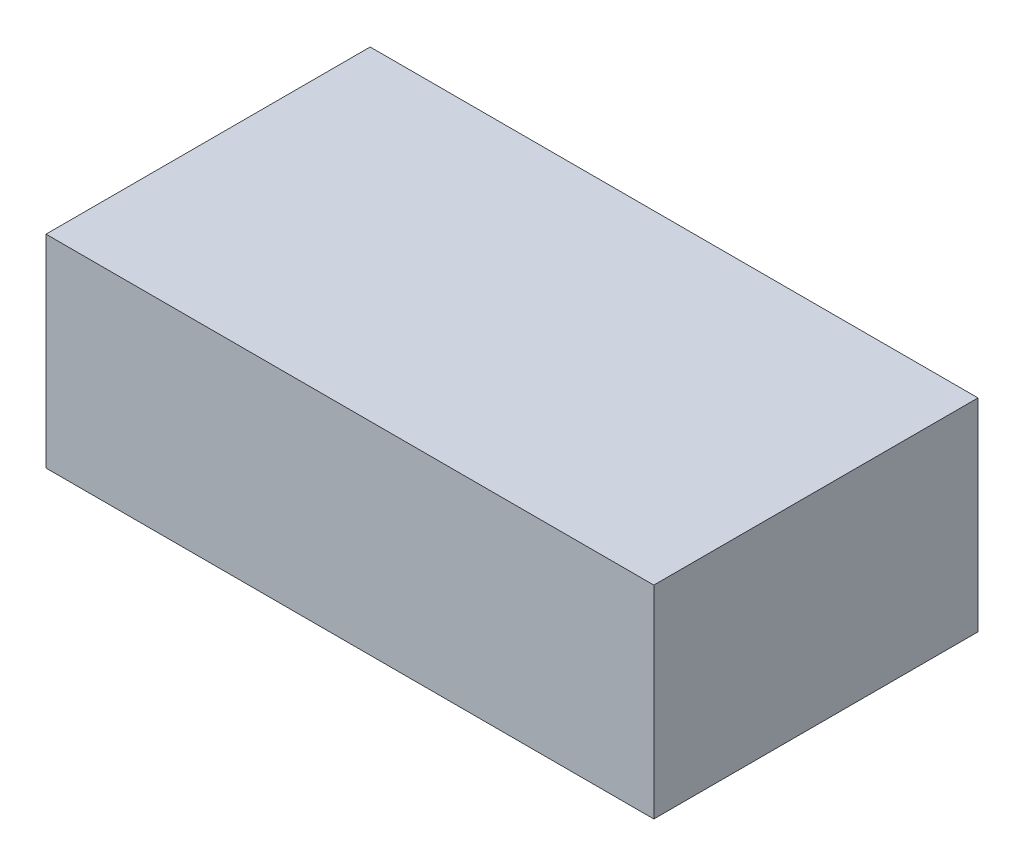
ISO-10303-21;
HEADER;
FILE_DESCRIPTION(('STEP AP214'),'2;1');
FILE_NAME('part.step','',(''),(''),'','','');
FILE_SCHEMA(('AUTOMOTIVE_DESIGN { 1 0 10303 214 1 1 1 1 }'));
ENDSEC;
DATA;
#1=APPLICATION_CONTEXT('core data for automotive mechanical design processes');
#2=APPLICATION_PROTOCOL_DEFINITION('international standard','automotive_design',2000,#1);
#3=PRODUCT_CONTEXT('',#1,'mechanical');
#4=PRODUCT('Part','Part','',(#3));
#5=PRODUCT_RELATED_PRODUCT_CATEGORY('part','',(#4));
#6=PRODUCT_DEFINITION_FORMATION('','',#4);
#7=PRODUCT_DEFINITION_CONTEXT('part definition',#1,'design');
#8=PRODUCT_DEFINITION('design','',#6,#7);
#9=PRODUCT_DEFINITION_SHAPE('','',#8);
#10=(LENGTH_UNIT() NAMED_UNIT(*) SI_UNIT(.MILLI.,.METRE.));
#11=(NAMED_UNIT(*) PLANE_ANGLE_UNIT() SI_UNIT($,.RADIAN.));
#12=(NAMED_UNIT(*) SI_UNIT($,.STERADIAN.) SOLID_ANGLE_UNIT());
#13=UNCERTAINTY_MEASURE_WITH_UNIT(LENGTH_MEASURE(1.E-05),#10,'distance_accuracy_value','');
#14=(GEOMETRIC_REPRESENTATION_CONTEXT(3) GLOBAL_UNCERTAINTY_ASSIGNED_CONTEXT((#13)) GLOBAL_UNIT_ASSIGNED_CONTEXT((#10,
#11,#12)) REPRESENTATION_CONTEXT('',''));
#15=CARTESIAN_POINT('',(0.,0.,0.));
#16=DIRECTION('',(0.,0.,1.));
#17=DIRECTION('',(1.,0.,0.));
#18=AXIS2_PLACEMENT_3D('',#15,#16,#17);
#19=CARTESIAN_POINT('',(0.,7.98492676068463,0.));
#20=DIRECTION('',(0.,1.,0.));
#21=DIRECTION('',(0.,0.,1.));
#22=AXIS2_PLACEMENT_3D('',#19,#20,#21);
#23=PLANE('',#22);
#24=DIRECTION('',(0.,0.,1.));
#25=VECTOR('',#24,1.);
#26=CARTESIAN_POINT('',(-88.3451897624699,7.98492676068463,-40.));
#27=LINE('',#26,#25);
#28=CARTESIAN_POINT('',(-88.3451897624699,7.98492676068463,-40.));
#29=VERTEX_POINT('',#28);
#30=CARTESIAN_POINT('',(-88.3451897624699,7.98492676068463,40.));
#31=VERTEX_POINT('',#30);
#32=EDGE_CURVE('E149',#29,#31,#27,.T.);
#33=ORIENTED_EDGE('',*,*,#32,.F.);
#34=DIRECTION('',(1.,0.,0.));
#35=VECTOR('',#34,1.);
#36=CARTESIAN_POINT('',(-88.3451897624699,7.98492676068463,-40.));
#37=LINE('',#36,#35);
#38=CARTESIAN_POINT('',(61.6548102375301,7.98492676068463,-40.));
#39=VERTEX_POINT('',#38);
#40=EDGE_CURVE('E155',#29,#39,#37,.T.);
#41=ORIENTED_EDGE('',*,*,#40,.T.);
#42=DIRECTION('',(0.,0.,1.));
#43=VECTOR('',#42,1.);
#44=CARTESIAN_POINT('',(61.6548102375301,7.98492676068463,-40.));
#45=LINE('',#44,#43);
#46=CARTESIAN_POINT('',(61.6548102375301,7.98492676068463,40.));
#47=VERTEX_POINT('',#46);
#48=EDGE_CURVE('E166',#39,#47,#45,.T.);
#49=ORIENTED_EDGE('',*,*,#48,.T.);
#50=DIRECTION('',(1.,0.,0.));
#51=VECTOR('',#50,1.);
#52=CARTESIAN_POINT('',(-88.3451897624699,7.98492676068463,40.));
#53=LINE('',#52,#51);
#54=EDGE_CURVE('E163',#31,#47,#53,.T.);
#55=ORIENTED_EDGE('',*,*,#54,.F.);
#56=EDGE_LOOP('',(#33,#41,#49,#55));
#57=FACE_BOUND('',#56,.T.);
#58=DIRECTION('',(0.,0.,-1.));
#59=VECTOR('',#58,1.);
#60=CARTESIAN_POINT('',(-63.1459556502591,7.98492676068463,0.));
#61=LINE('',#60,#59);
#62=CARTESIAN_POINT('',(-63.1459556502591,7.98492676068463,21.5121002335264));
#63=VERTEX_POINT('',#62);
#64=CARTESIAN_POINT('',(-63.1459556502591,7.98492676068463,-18.4878997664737));
#65=VERTEX_POINT('',#64);
#66=EDGE_CURVE('E11',#63,#65,#61,.T.);
#67=ORIENTED_EDGE('',*,*,#66,.F.);
#68=CARTESIAN_POINT('',(-53.1459556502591,7.98492676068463,21.5121002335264));
#69=DIRECTION('',(0.,1.,0.));
#70=DIRECTION('',(0.,0.,1.));
#71=AXIS2_PLACEMENT_3D('',#68,#69,#70);
#72=CIRCLE('',#71,10.);
#73=CARTESIAN_POINT('',(-53.145955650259,7.98492676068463,31.5121002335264));
#74=VERTEX_POINT('',#73);
#75=EDGE_CURVE('E135',#74,#63,#72,.F.);
#76=ORIENTED_EDGE('',*,*,#75,.F.);
#77=DIRECTION('',(-1.,0.,0.));
#78=VECTOR('',#77,1.);
#79=CARTESIAN_POINT('',(-63.1459556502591,7.98492676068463,31.5121002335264));
#80=LINE('',#79,#78);
#81=CARTESIAN_POINT('',(2.71190872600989,7.98492676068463,31.5121002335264));
#82=VERTEX_POINT('',#81);
#83=EDGE_CURVE('E127',#82,#74,#80,.T.);
#84=ORIENTED_EDGE('',*,*,#83,.F.);
#85=CARTESIAN_POINT('',(2.71190872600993,7.98492676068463,21.5121002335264));
#86=DIRECTION('',(0.,1.,0.));
#87=DIRECTION('',(0.,0.,1.));
#88=AXIS2_PLACEMENT_3D('',#85,#86,#87);
#89=CIRCLE('',#88,10.);
#90=CARTESIAN_POINT('',(9.78297653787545,7.98492676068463,28.5831680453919));
#91=VERTEX_POINT('',#90);
#92=EDGE_CURVE('E118',#91,#82,#89,.F.);
#93=ORIENTED_EDGE('',*,*,#92,.F.);
#94=DIRECTION('',(0.707106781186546,0.,-0.707106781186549));
#95=VECTOR('',#94,1.);
#96=CARTESIAN_POINT('',(36.8540443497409,7.98492676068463,1.51210023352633));
#97=LINE('',#96,#95);
#98=CARTESIAN_POINT('',(36.8540443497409,7.98492676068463,1.51210023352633));
#99=VERTEX_POINT('',#98);
#100=EDGE_CURVE('E107',#99,#91,#97,.F.);
#101=ORIENTED_EDGE('',*,*,#100,.F.);
#102=DIRECTION('',(-0.707106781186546,0.,-0.707106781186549));
#103=VECTOR('',#102,1.);
#104=CARTESIAN_POINT('',(36.8540443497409,7.98492676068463,1.51210023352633));
#105=LINE('',#104,#103);
#106=CARTESIAN_POINT('',(9.78297653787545,7.98492676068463,-25.5589675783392));
#107=VERTEX_POINT('',#106);
#108=EDGE_CURVE('E48',#107,#99,#105,.F.);
#109=ORIENTED_EDGE('',*,*,#108,.F.);
#110=CARTESIAN_POINT('',(2.71190872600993,7.98492676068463,-18.4878997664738));
#111=DIRECTION('',(0.,1.,0.));
#112=DIRECTION('',(0.,0.,1.));
#113=AXIS2_PLACEMENT_3D('',#110,#111,#112);
#114=CIRCLE('',#113,10.);
#115=CARTESIAN_POINT('',(2.71190872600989,7.98492676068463,-28.4878997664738));
#116=VERTEX_POINT('',#115);
#117=EDGE_CURVE('E121',#116,#107,#114,.F.);
#118=ORIENTED_EDGE('',*,*,#117,.F.);
#119=DIRECTION('',(-1.,0.,0.));
#120=VECTOR('',#119,1.);
#121=CARTESIAN_POINT('',(-63.1459556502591,7.98492676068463,-28.4878997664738));
#122=LINE('',#121,#120);
#123=CARTESIAN_POINT('',(-53.145955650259,7.98492676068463,-28.4878997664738));
#124=VERTEX_POINT('',#123);
#125=EDGE_CURVE('E133',#124,#116,#122,.F.);
#126=ORIENTED_EDGE('',*,*,#125,.F.);
#127=CARTESIAN_POINT('',(-53.1459556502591,7.98492676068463,-18.4878997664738));
#128=DIRECTION('',(0.,1.,0.));
#129=DIRECTION('',(0.,0.,1.));
#130=AXIS2_PLACEMENT_3D('',#127,#128,#129);
#131=CIRCLE('',#130,10.);
#132=EDGE_CURVE('E41',#65,#124,#131,.F.);
#133=ORIENTED_EDGE('',*,*,#132,.F.);
#134=EDGE_LOOP('',(#67,#76,#84,#93,#101,#109,#118,#126,#133));
#135=FACE_BOUND('',#134,.T.);
#136=ADVANCED_FACE('F33',(#57,#135),#23,.F.);
#137=CARTESIAN_POINT('',(-88.3451897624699,57.9849267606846,-40.));
#138=DIRECTION('',(1.,0.,0.));
#139=DIRECTION('',(0.,0.,-1.));
#140=AXIS2_PLACEMENT_3D('',#137,#138,#139);
#141=PLANE('',#140);
#142=ORIENTED_EDGE('',*,*,#32,.T.);
#143=DIRECTION('',(0.,-1.,0.));
#144=VECTOR('',#143,1.);
#145=CARTESIAN_POINT('',(-88.3451897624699,57.9849267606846,40.));
#146=LINE('',#145,#144);
#147=CARTESIAN_POINT('',(-88.3451897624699,57.9849267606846,40.));
#148=VERTEX_POINT('',#147);
#149=EDGE_CURVE('E113',#148,#31,#146,.T.);
#150=ORIENTED_EDGE('',*,*,#149,.F.);
#151=DIRECTION('',(0.,0.,1.));
#152=VECTOR('',#151,1.);
#153=CARTESIAN_POINT('',(-88.3451897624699,57.9849267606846,-40.));
#154=LINE('',#153,#152);
#155=CARTESIAN_POINT('',(-88.3451897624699,57.9849267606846,-40.));
#156=VERTEX_POINT('',#155);
#157=EDGE_CURVE('E153',#156,#148,#154,.T.);
#158=ORIENTED_EDGE('',*,*,#157,.F.);
#159=DIRECTION('',(0.,-1.,0.));
#160=VECTOR('',#159,1.);
#161=CARTESIAN_POINT('',(-88.3451897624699,57.9849267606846,-40.));
#162=LINE('',#161,#160);
#163=EDGE_CURVE('E57',#156,#29,#162,.T.);
#164=ORIENTED_EDGE('',*,*,#163,.T.);
#165=EDGE_LOOP('',(#142,#150,#158,#164));
#166=FACE_BOUND('',#165,.T.);
#167=ADVANCED_FACE('F35',(#166),#141,.F.);
#168=CARTESIAN_POINT('',(-88.3451897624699,57.9849267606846,40.));
#169=DIRECTION('',(0.,0.,-1.));
#170=DIRECTION('',(-1.,0.,0.));
#171=AXIS2_PLACEMENT_3D('',#168,#169,#170);
#172=PLANE('',#171);
#173=ORIENTED_EDGE('',*,*,#54,.T.);
#174=DIRECTION('',(0.,-1.,0.));
#175=VECTOR('',#174,1.);
#176=CARTESIAN_POINT('',(61.6548102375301,57.9849267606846,40.));
#177=LINE('',#176,#175);
#178=CARTESIAN_POINT('',(61.6548102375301,57.9849267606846,40.));
#179=VERTEX_POINT('',#178);
#180=EDGE_CURVE('E174',#179,#47,#177,.T.);
#181=ORIENTED_EDGE('',*,*,#180,.F.);
#182=DIRECTION('',(1.,0.,0.));
#183=VECTOR('',#182,1.);
#184=CARTESIAN_POINT('',(-88.3451897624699,57.9849267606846,40.));
#185=LINE('',#184,#183);
#186=EDGE_CURVE('E84',#148,#179,#185,.T.);
#187=ORIENTED_EDGE('',*,*,#186,.F.);
#188=ORIENTED_EDGE('',*,*,#149,.T.);
#189=EDGE_LOOP('',(#173,#181,#187,#188));
#190=FACE_BOUND('',#189,.T.);
#191=ADVANCED_FACE('F177',(#190),#172,.F.);
#192=CARTESIAN_POINT('',(61.6548102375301,57.9849267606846,-40.));
#193=DIRECTION('',(1.,0.,0.));
#194=DIRECTION('',(0.,0.,-1.));
#195=AXIS2_PLACEMENT_3D('',#192,#193,#194);
#196=PLANE('',#195);
#197=ORIENTED_EDGE('',*,*,#48,.F.);
#198=DIRECTION('',(0.,-1.,0.));
#199=VECTOR('',#198,1.);
#200=CARTESIAN_POINT('',(61.6548102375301,57.9849267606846,-40.));
#201=LINE('',#200,#199);
#202=CARTESIAN_POINT('',(61.6548102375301,57.9849267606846,-40.));
#203=VERTEX_POINT('',#202);
#204=EDGE_CURVE('E172',#203,#39,#201,.T.);
#205=ORIENTED_EDGE('',*,*,#204,.F.);
#206=DIRECTION('',(0.,0.,1.));
#207=VECTOR('',#206,1.);
#208=CARTESIAN_POINT('',(61.6548102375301,57.9849267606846,-40.));
#209=LINE('',#208,#207);
#210=EDGE_CURVE('E157',#203,#179,#209,.T.);
#211=ORIENTED_EDGE('',*,*,#210,.T.);
#212=ORIENTED_EDGE('',*,*,#180,.T.);
#213=EDGE_LOOP('',(#197,#205,#211,#212));
#214=FACE_BOUND('',#213,.T.);
#215=ADVANCED_FACE('F184',(#214),#196,.T.);
#216=CARTESIAN_POINT('',(-88.3451897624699,57.9849267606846,-40.));
#217=DIRECTION('',(0.,0.,-1.));
#218=DIRECTION('',(-1.,0.,0.));
#219=AXIS2_PLACEMENT_3D('',#216,#217,#218);
#220=PLANE('',#219);
#221=ORIENTED_EDGE('',*,*,#40,.F.);
#222=ORIENTED_EDGE('',*,*,#163,.F.);
#223=DIRECTION('',(1.,0.,0.));
#224=VECTOR('',#223,1.);
#225=CARTESIAN_POINT('',(-88.3451897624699,57.9849267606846,-40.));
#226=LINE('',#225,#224);
#227=EDGE_CURVE('E160',#156,#203,#226,.T.);
#228=ORIENTED_EDGE('',*,*,#227,.T.);
#229=ORIENTED_EDGE('',*,*,#204,.T.);
#230=EDGE_LOOP('',(#221,#222,#228,#229));
#231=FACE_BOUND('',#230,.T.);
#232=ADVANCED_FACE('F179',(#231),#220,.T.);
#233=CARTESIAN_POINT('',(0.,57.9849267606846,0.));
#234=DIRECTION('',(0.,1.,0.));
#235=DIRECTION('',(0.,0.,1.));
#236=AXIS2_PLACEMENT_3D('',#233,#234,#235);
#237=PLANE('',#236);
#238=ORIENTED_EDGE('',*,*,#157,.T.);
#239=ORIENTED_EDGE('',*,*,#186,.T.);
#240=ORIENTED_EDGE('',*,*,#210,.F.);
#241=ORIENTED_EDGE('',*,*,#227,.F.);
#242=EDGE_LOOP('',(#238,#239,#240,#241));
#243=FACE_BOUND('',#242,.T.);
#244=ADVANCED_FACE('F186',(#243),#237,.T.);
#245=CARTESIAN_POINT('',(-63.1459556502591,7.98492676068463,1.51210023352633));
#246=DIRECTION('',(1.,0.,0.));
#247=DIRECTION('',(0.,0.,-1.));
#248=AXIS2_PLACEMENT_3D('',#245,#246,#247);
#249=PLANE('',#248);
#250=ORIENTED_EDGE('',*,*,#66,.T.);
#251=CARTESIAN_POINT('',(-63.1459556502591,7.98492676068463,1.51210023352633));
#252=DIRECTION('',(-1.,0.,0.));
#253=DIRECTION('',(0.,0.,1.));
#254=AXIS2_PLACEMENT_3D('',#251,#252,#253);
#255=CIRCLE('',#254,20.);
#256=EDGE_CURVE('E144',#63,#65,#255,.T.);
#257=ORIENTED_EDGE('',*,*,#256,.F.);
#258=EDGE_LOOP('',(#250,#257));
#259=FACE_BOUND('',#258,.T.);
#260=ADVANCED_FACE('F188',(#259),#249,.T.);
#261=CARTESIAN_POINT('',(-53.1459556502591,7.98492676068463,1.51210023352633));
#262=DIRECTION('',(-1.,0.,0.));
#263=DIRECTION('',(0.,0.,1.));
#264=AXIS2_PLACEMENT_3D('',#261,#262,#263);
#265=TOROIDAL_SURFACE('',#264,20.0000000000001,10.);
#266=ORIENTED_EDGE('',*,*,#132,.T.);
#267=CARTESIAN_POINT('',(-53.145955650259,7.98492676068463,1.51210023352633));
#268=DIRECTION('',(-1.,0.,0.));
#269=DIRECTION('',(0.,0.,1.));
#270=AXIS2_PLACEMENT_3D('',#267,#268,#269);
#271=CIRCLE('',#270,30.0000000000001);
#272=EDGE_CURVE('E142',#74,#124,#271,.T.);
#273=ORIENTED_EDGE('',*,*,#272,.F.);
#274=ORIENTED_EDGE('',*,*,#75,.T.);
#275=ORIENTED_EDGE('',*,*,#256,.T.);
#276=EDGE_LOOP('',(#266,#273,#274,#275));
#277=FACE_BOUND('',#276,.T.);
#278=ADVANCED_FACE('F141',(#277),#265,.F.);
#279=CARTESIAN_POINT('',(-63.1459556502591,7.98492676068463,1.51210023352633));
#280=DIRECTION('',(-1.,0.,0.));
#281=DIRECTION('',(0.,0.,1.));
#282=AXIS2_PLACEMENT_3D('',#279,#280,#281);
#283=CYLINDRICAL_SURFACE('',#282,30.0000000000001);
#284=ORIENTED_EDGE('',*,*,#125,.T.);
#285=CARTESIAN_POINT('',(2.71190872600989,7.98492676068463,1.51210023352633));
#286=DIRECTION('',(-1.,0.,0.));
#287=DIRECTION('',(0.,0.,1.));
#288=AXIS2_PLACEMENT_3D('',#285,#286,#287);
#289=CIRCLE('',#288,30.0000000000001);
#290=EDGE_CURVE('E122',#82,#116,#289,.T.);
#291=ORIENTED_EDGE('',*,*,#290,.F.);
#292=ORIENTED_EDGE('',*,*,#83,.T.);
#293=ORIENTED_EDGE('',*,*,#272,.T.);
#294=EDGE_LOOP('',(#284,#291,#292,#293));
#295=FACE_BOUND('',#294,.T.);
#296=ADVANCED_FACE('F147',(#295),#283,.F.);
#297=CARTESIAN_POINT('',(2.71190872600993,7.98492676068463,1.51210023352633));
#298=DIRECTION('',(-1.,0.,0.));
#299=DIRECTION('',(0.,0.,1.));
#300=AXIS2_PLACEMENT_3D('',#297,#298,#299);
#301=TOROIDAL_SURFACE('',#300,20.0000000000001,10.);
#302=ORIENTED_EDGE('',*,*,#117,.T.);
#303=CARTESIAN_POINT('',(9.78297653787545,7.98492676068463,1.51210023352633));
#304=DIRECTION('',(-1.,0.,0.));
#305=DIRECTION('',(0.,0.,1.));
#306=AXIS2_PLACEMENT_3D('',#303,#304,#305);
#307=CIRCLE('',#306,27.0710678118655);
#308=EDGE_CURVE('E110',#91,#107,#307,.T.);
#309=ORIENTED_EDGE('',*,*,#308,.F.);
#310=ORIENTED_EDGE('',*,*,#92,.T.);
#311=ORIENTED_EDGE('',*,*,#290,.T.);
#312=EDGE_LOOP('',(#302,#309,#310,#311));
#313=FACE_BOUND('',#312,.T.);
#314=ADVANCED_FACE('F116',(#313),#301,.F.);
#315=CARTESIAN_POINT('',(36.8540443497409,7.98492676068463,1.51210023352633));
#316=DIRECTION('',(-1.,0.,0.));
#317=DIRECTION('',(0.,0.,1.));
#318=AXIS2_PLACEMENT_3D('',#315,#316,#317);
#319=CONICAL_SURFACE('',#318,0.,0.78539816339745);
#320=ORIENTED_EDGE('',*,*,#108,.T.);
#321=ORIENTED_EDGE('',*,*,#100,.T.);
#322=ORIENTED_EDGE('',*,*,#308,.T.);
#323=EDGE_LOOP('',(#320,#321,#322));
#324=FACE_BOUND('',#323,.T.);
#325=ADVANCED_FACE('F109',(#324),#319,.F.);
#326=CLOSED_SHELL('',(#136,#167,#191,#215,#232,#244,#260,#278,#296,#314,#325));
#327=MANIFOLD_SOLID_BREP('B2',#326);
#328=ADVANCED_BREP_SHAPE_REPRESENTATION('',(#18,#327),#14);
#329=SHAPE_DEFINITION_REPRESENTATION(#9,#328);
ENDSEC;
END-ISO-10303-21;
